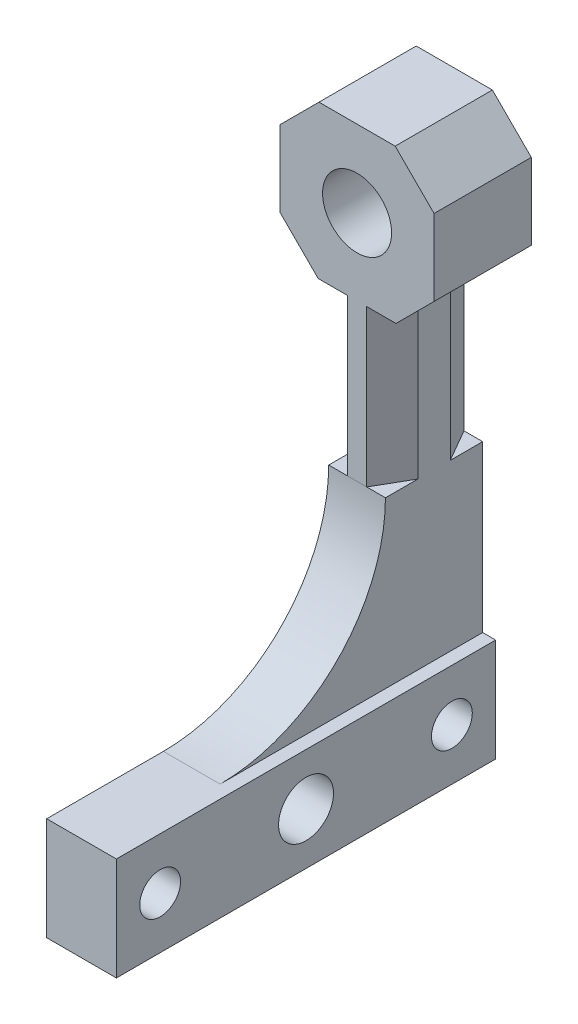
from build123d import *

# Parameters (mm, degrees)
EXTRUDE1_DEPTH                 = 7.62
EXTRUDE2_DEPTH                 = 2.2225
EXTRUDE2_DEPTH_BACK            = 2.2225
SKETCH3_W                      = 29.718
SKETCH3_H                      = 8.0772
SKETCH10_W                     = 29.718
SKETCH10_H                     = 8.0772
EXTRUDE3_DEPTH                 = 1.016
FILLET3_R                      = 12.954
F_18_0_169500_DIAMETER_HOLE1_D = 4.3053
F_1_4_28_TAPPED_HOLE1_D        = 5.4102
CHAMFER1_SIZE                  = 3.048
F_1_8_LC2_HOLE_D               = 3.2004
SKETCH14_OUTSIDE_W             = 25.164
SKETCH14_OUTSIDE_H             = 42.816
CUT_EXTRUDE5_DEPTH             = 12.2428


with BuildPart() as part:
    # Sketch1 → Extrude1 (new body)
    with BuildSketch(Plane.XY):
        Polygon((-2.2225, -6.0325), (-2.2225, -31.1658), (2.2225, -31.1658), (2.2225, -6.0325), (6.0325, -6.0325), (6.0325, 6.0325), (-6.0325, 6.0325), (-6.0325, -6.0325), align=None)
    extrude(amount=EXTRUDE1_DEPTH)

    # Sketch3 → Extrude2 (add, two sides: drawn at the far end of the back side and taken through both)
    with BuildSketch(Plane(origin=(0, 0, 0), x_dir=(0, 0, -1), z_dir=(1, 0, 0)).offset(-EXTRUDE2_DEPTH_BACK)):
        with Locations((-14.859, -35.2044)):
            Rectangle(SKETCH3_W, SKETCH3_H)
    extrude(amount=EXTRUDE2_DEPTH + EXTRUDE2_DEPTH_BACK)

    # Sketch10 → Extrude3 (add)
    with BuildSketch(Plane(origin=(2.2225, 0, 0), x_dir=(0, 0, -1), z_dir=(1, 0, 0))):
        with Locations((-14.859, -35.2044)):
            Rectangle(SKETCH10_W, SKETCH10_H)
    extrude(amount=EXTRUDE3_DEPTH)

    # Fillet3
    fillet3_edges = [part.edges().sort_by_distance(p)[0] for p in [
        (0, -31.1658, 7.62),
    ]]
    fillet(fillet3_edges, radius=FILLET3_R)

    # 18 _0.169500_ Diameter Hole1 (through all)
    with Locations(Plane(origin=(3.2385, 1.208377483, -11.786109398), x_dir=(0, 0, -1), z_dir=(1, 0, 0))):
        with Locations((-26.645109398, -36.412777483)):
            Hole(F_18_0_169500_DIAMETER_HOLE1_D / 2)

    # 1_4-28 Tapped Hole1 (through all)
    with Locations(Plane(origin=(0, 0, 0), x_dir=(-1, 0, 0), z_dir=(0, 0, -1))):
        with Locations((0, 0)):
            Hole(F_1_4_28_TAPPED_HOLE1_D / 2)

    # Chamfer1
    chamfer1_edges = [part.edges().sort_by_distance(p)[0] for p in [
        (-6.0325, 6.0325, 3.81),
        (6.0325, 6.0325, 3.81),
        (6.0325, -6.0325, 3.81),
        (-6.0325, -6.0325, 3.81),
    ]]
    chamfer(chamfer1_edges, length=CHAMFER1_SIZE)

    # 1_8 LC2 Hole (through all)
    with Locations(Plane(origin=(3.2385, 0.507613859, -7.345813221), x_dir=(0, 0, -1), z_dir=(1, 0, 0))):
        with Locations((-33.634813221, -35.712013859), (-10.774813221, -35.712013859)):
            Hole(F_1_8_LC2_HOLE_D / 2)

    # Sketch14 outside → Cut-Extrude5 (cut)
    with BuildSketch(Plane(origin=(0, -5.969, 0), x_dir=(-1, 0, 0), z_dir=(0, 1, 0))):
        with Locations((0, 14.859)):
            Rectangle(SKETCH14_OUTSIDE_W, SKETCH14_OUTSIDE_H)
        Polygon((0.756030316, 7.62), (2.2225, 5.08), (2.2225, 2.54), (0.756030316, 0), (-0.756030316, 0), (-2.2225, 2.54), (-2.2225, 5.08), (-0.756030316, 7.62), align=None, mode=Mode.SUBTRACT)
    extrude(amount=-CUT_EXTRUDE5_DEPTH, mode=Mode.SUBTRACT)


solid = part.part
